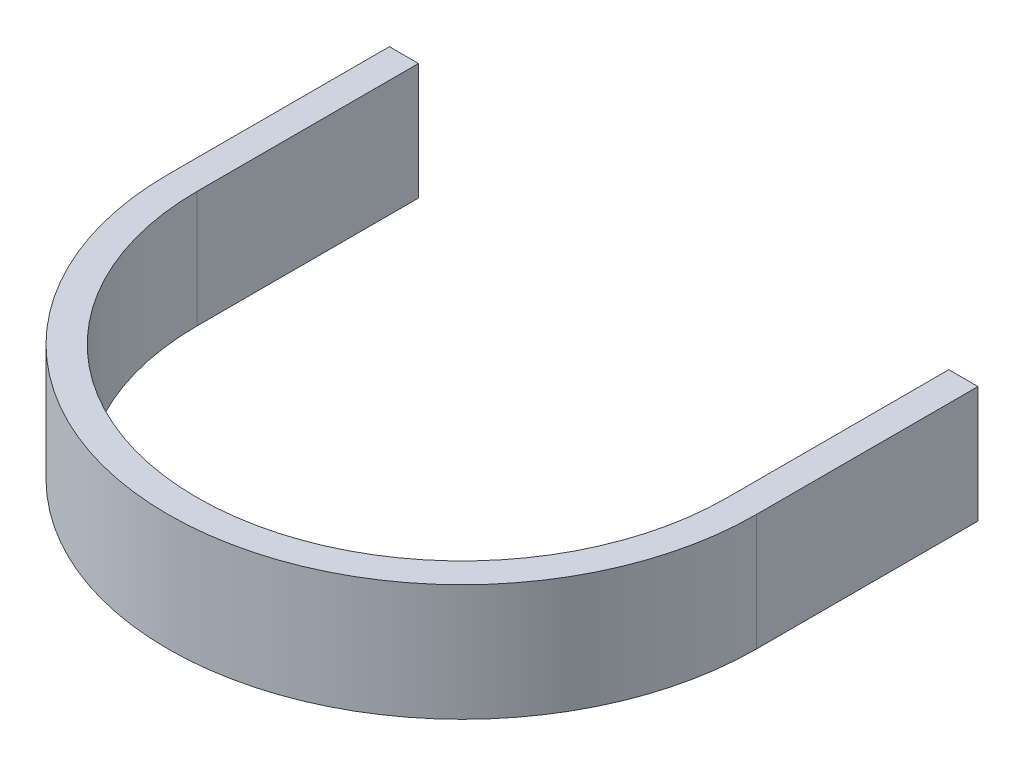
ISO-10303-21;
HEADER;
FILE_DESCRIPTION(('STEP AP214'),'2;1');
FILE_NAME('part.step','',(''),(''),'','','');
FILE_SCHEMA(('AUTOMOTIVE_DESIGN { 1 0 10303 214 1 1 1 1 }'));
ENDSEC;
DATA;
#1=APPLICATION_CONTEXT('core data for automotive mechanical design processes');
#2=APPLICATION_PROTOCOL_DEFINITION('international standard','automotive_design',2000,#1);
#3=PRODUCT_CONTEXT('',#1,'mechanical');
#4=PRODUCT('Part','Part','',(#3));
#5=PRODUCT_RELATED_PRODUCT_CATEGORY('part','',(#4));
#6=PRODUCT_DEFINITION_FORMATION('','',#4);
#7=PRODUCT_DEFINITION_CONTEXT('part definition',#1,'design');
#8=PRODUCT_DEFINITION('design','',#6,#7);
#9=PRODUCT_DEFINITION_SHAPE('','',#8);
#10=(LENGTH_UNIT() NAMED_UNIT(*) SI_UNIT(.MILLI.,.METRE.));
#11=(NAMED_UNIT(*) PLANE_ANGLE_UNIT() SI_UNIT($,.RADIAN.));
#12=(NAMED_UNIT(*) SI_UNIT($,.STERADIAN.) SOLID_ANGLE_UNIT());
#13=UNCERTAINTY_MEASURE_WITH_UNIT(LENGTH_MEASURE(1.E-05),#10,'distance_accuracy_value','');
#14=(GEOMETRIC_REPRESENTATION_CONTEXT(3) GLOBAL_UNCERTAINTY_ASSIGNED_CONTEXT((#13)) GLOBAL_UNIT_ASSIGNED_CONTEXT((#10,
#11,#12)) REPRESENTATION_CONTEXT('',''));
#15=CARTESIAN_POINT('',(0.,0.,0.));
#16=DIRECTION('',(0.,0.,1.));
#17=DIRECTION('',(1.,0.,0.));
#18=AXIS2_PLACEMENT_3D('',#15,#16,#17);
#19=CARTESIAN_POINT('',(-50.5,20.,-8.));
#20=DIRECTION('',(0.,0.,1.));
#21=DIRECTION('',(1.,0.,0.));
#22=AXIS2_PLACEMENT_3D('',#19,#20,#21);
#23=PLANE('',#22);
#24=DIRECTION('',(-1.,0.,0.));
#25=VECTOR('',#24,1.);
#26=CARTESIAN_POINT('',(-50.5,0.,-8.));
#27=LINE('',#26,#25);
#28=CARTESIAN_POINT('',(-45.5,0.,-8.));
#29=VERTEX_POINT('',#28);
#30=CARTESIAN_POINT('',(-50.5,0.,-8.));
#31=VERTEX_POINT('',#30);
#32=EDGE_CURVE('E129',#29,#31,#27,.T.);
#33=ORIENTED_EDGE('',*,*,#32,.T.);
#34=DIRECTION('',(0.,-1.,0.));
#35=VECTOR('',#34,1.);
#36=CARTESIAN_POINT('',(-50.5,20.,-8.));
#37=LINE('',#36,#35);
#38=CARTESIAN_POINT('',(-50.5,20.,-8.));
#39=VERTEX_POINT('',#38);
#40=EDGE_CURVE('E11',#39,#31,#37,.T.);
#41=ORIENTED_EDGE('',*,*,#40,.F.);
#42=DIRECTION('',(-1.,0.,0.));
#43=VECTOR('',#42,1.);
#44=CARTESIAN_POINT('',(-50.5,20.,-8.));
#45=LINE('',#44,#43);
#46=CARTESIAN_POINT('',(-45.5,20.,-8.));
#47=VERTEX_POINT('',#46);
#48=EDGE_CURVE('E143',#47,#39,#45,.T.);
#49=ORIENTED_EDGE('',*,*,#48,.F.);
#50=DIRECTION('',(0.,-1.,0.));
#51=VECTOR('',#50,1.);
#52=CARTESIAN_POINT('',(-45.5,20.,-8.));
#53=LINE('',#52,#51);
#54=EDGE_CURVE('E125',#47,#29,#53,.T.);
#55=ORIENTED_EDGE('',*,*,#54,.T.);
#56=EDGE_LOOP('',(#33,#41,#49,#55));
#57=FACE_BOUND('',#56,.T.);
#58=ADVANCED_FACE('F33',(#57),#23,.F.);
#59=CARTESIAN_POINT('',(-50.5,20.,30.));
#60=DIRECTION('',(1.,0.,0.));
#61=DIRECTION('',(0.,0.,-1.));
#62=AXIS2_PLACEMENT_3D('',#59,#60,#61);
#63=PLANE('',#62);
#64=DIRECTION('',(0.,0.,1.));
#65=VECTOR('',#64,1.);
#66=CARTESIAN_POINT('',(-50.5,0.,30.));
#67=LINE('',#66,#65);
#68=CARTESIAN_POINT('',(-50.5,0.,30.));
#69=VERTEX_POINT('',#68);
#70=EDGE_CURVE('E132',#31,#69,#67,.T.);
#71=ORIENTED_EDGE('',*,*,#70,.T.);
#72=DIRECTION('',(0.,-1.,0.));
#73=VECTOR('',#72,1.);
#74=CARTESIAN_POINT('',(-50.5,20.,30.));
#75=LINE('',#74,#73);
#76=CARTESIAN_POINT('',(-50.5,20.,30.));
#77=VERTEX_POINT('',#76);
#78=EDGE_CURVE('E41',#77,#69,#75,.T.);
#79=ORIENTED_EDGE('',*,*,#78,.F.);
#80=DIRECTION('',(0.,0.,1.));
#81=VECTOR('',#80,1.);
#82=CARTESIAN_POINT('',(-50.5,20.,30.));
#83=LINE('',#82,#81);
#84=EDGE_CURVE('E92',#39,#77,#83,.T.);
#85=ORIENTED_EDGE('',*,*,#84,.F.);
#86=ORIENTED_EDGE('',*,*,#40,.T.);
#87=EDGE_LOOP('',(#71,#79,#85,#86));
#88=FACE_BOUND('',#87,.T.);
#89=ADVANCED_FACE('F178',(#88),#63,.F.);
#90=CARTESIAN_POINT('',(0.,20.,30.));
#91=DIRECTION('',(0.,-1.,0.));
#92=DIRECTION('',(0.,0.,-1.));
#93=AXIS2_PLACEMENT_3D('',#90,#91,#92);
#94=CYLINDRICAL_SURFACE('',#93,50.5);
#95=CARTESIAN_POINT('',(0.,0.,30.));
#96=DIRECTION('',(0.,1.,0.));
#97=DIRECTION('',(0.,0.,1.));
#98=AXIS2_PLACEMENT_3D('',#95,#96,#97);
#99=CIRCLE('',#98,50.5);
#100=CARTESIAN_POINT('',(50.5,0.,30.));
#101=VERTEX_POINT('',#100);
#102=EDGE_CURVE('E134',#69,#101,#99,.T.);
#103=ORIENTED_EDGE('',*,*,#102,.T.);
#104=DIRECTION('',(0.,-1.,0.));
#105=VECTOR('',#104,1.);
#106=CARTESIAN_POINT('',(50.5,20.,30.));
#107=LINE('',#106,#105);
#108=CARTESIAN_POINT('',(50.5,20.,30.));
#109=VERTEX_POINT('',#108);
#110=EDGE_CURVE('E150',#109,#101,#107,.T.);
#111=ORIENTED_EDGE('',*,*,#110,.F.);
#112=CARTESIAN_POINT('',(0.,20.,30.));
#113=DIRECTION('',(0.,1.,0.));
#114=DIRECTION('',(0.,0.,1.));
#115=AXIS2_PLACEMENT_3D('',#112,#113,#114);
#116=CIRCLE('',#115,50.5);
#117=EDGE_CURVE('E158',#77,#109,#116,.T.);
#118=ORIENTED_EDGE('',*,*,#117,.F.);
#119=ORIENTED_EDGE('',*,*,#78,.T.);
#120=EDGE_LOOP('',(#103,#111,#118,#119));
#121=FACE_BOUND('',#120,.T.);
#122=ADVANCED_FACE('F156',(#121),#94,.T.);
#123=CARTESIAN_POINT('',(50.5,20.,30.));
#124=DIRECTION('',(-1.,0.,0.));
#125=DIRECTION('',(0.,0.,1.));
#126=AXIS2_PLACEMENT_3D('',#123,#124,#125);
#127=PLANE('',#126);
#128=DIRECTION('',(0.,0.,-1.));
#129=VECTOR('',#128,1.);
#130=CARTESIAN_POINT('',(50.5,0.,30.));
#131=LINE('',#130,#129);
#132=CARTESIAN_POINT('',(50.5,0.,-8.));
#133=VERTEX_POINT('',#132);
#134=EDGE_CURVE('E136',#101,#133,#131,.T.);
#135=ORIENTED_EDGE('',*,*,#134,.T.);
#136=DIRECTION('',(0.,-1.,0.));
#137=VECTOR('',#136,1.);
#138=CARTESIAN_POINT('',(50.5,20.,-8.));
#139=LINE('',#138,#137);
#140=CARTESIAN_POINT('',(50.5,20.,-8.));
#141=VERTEX_POINT('',#140);
#142=EDGE_CURVE('E147',#141,#133,#139,.T.);
#143=ORIENTED_EDGE('',*,*,#142,.F.);
#144=DIRECTION('',(0.,0.,-1.));
#145=VECTOR('',#144,1.);
#146=CARTESIAN_POINT('',(50.5,20.,30.));
#147=LINE('',#146,#145);
#148=EDGE_CURVE('E170',#109,#141,#147,.T.);
#149=ORIENTED_EDGE('',*,*,#148,.F.);
#150=ORIENTED_EDGE('',*,*,#110,.T.);
#151=EDGE_LOOP('',(#135,#143,#149,#150));
#152=FACE_BOUND('',#151,.T.);
#153=ADVANCED_FACE('F166',(#152),#127,.F.);
#154=CARTESIAN_POINT('',(50.5,20.,-8.));
#155=DIRECTION('',(0.,0.,1.));
#156=DIRECTION('',(1.,0.,0.));
#157=AXIS2_PLACEMENT_3D('',#154,#155,#156);
#158=PLANE('',#157);
#159=DIRECTION('',(-1.,0.,0.));
#160=VECTOR('',#159,1.);
#161=CARTESIAN_POINT('',(50.5,0.,-8.));
#162=LINE('',#161,#160);
#163=CARTESIAN_POINT('',(45.5,0.,-8.));
#164=VERTEX_POINT('',#163);
#165=EDGE_CURVE('E138',#133,#164,#162,.T.);
#166=ORIENTED_EDGE('',*,*,#165,.T.);
#167=DIRECTION('',(0.,-1.,0.));
#168=VECTOR('',#167,1.);
#169=CARTESIAN_POINT('',(45.5,20.,-8.));
#170=LINE('',#169,#168);
#171=CARTESIAN_POINT('',(45.5,20.,-8.));
#172=VERTEX_POINT('',#171);
#173=EDGE_CURVE('E120',#172,#164,#170,.T.);
#174=ORIENTED_EDGE('',*,*,#173,.F.);
#175=DIRECTION('',(-1.,0.,0.));
#176=VECTOR('',#175,1.);
#177=CARTESIAN_POINT('',(50.5,20.,-8.));
#178=LINE('',#177,#176);
#179=EDGE_CURVE('E111',#141,#172,#178,.T.);
#180=ORIENTED_EDGE('',*,*,#179,.F.);
#181=ORIENTED_EDGE('',*,*,#142,.T.);
#182=EDGE_LOOP('',(#166,#174,#180,#181));
#183=FACE_BOUND('',#182,.T.);
#184=ADVANCED_FACE('F169',(#183),#158,.F.);
#185=CARTESIAN_POINT('',(45.5,20.,-8.));
#186=DIRECTION('',(1.,0.,0.));
#187=DIRECTION('',(0.,0.,-1.));
#188=AXIS2_PLACEMENT_3D('',#185,#186,#187);
#189=PLANE('',#188);
#190=DIRECTION('',(0.,0.,1.));
#191=VECTOR('',#190,1.);
#192=CARTESIAN_POINT('',(45.5,0.,-8.));
#193=LINE('',#192,#191);
#194=CARTESIAN_POINT('',(45.5,0.,30.));
#195=VERTEX_POINT('',#194);
#196=EDGE_CURVE('E119',#164,#195,#193,.T.);
#197=ORIENTED_EDGE('',*,*,#196,.T.);
#198=DIRECTION('',(0.,-1.,0.));
#199=VECTOR('',#198,1.);
#200=CARTESIAN_POINT('',(45.5,20.,30.));
#201=LINE('',#200,#199);
#202=CARTESIAN_POINT('',(45.5,20.,30.));
#203=VERTEX_POINT('',#202);
#204=EDGE_CURVE('E116',#203,#195,#201,.T.);
#205=ORIENTED_EDGE('',*,*,#204,.F.);
#206=DIRECTION('',(0.,0.,1.));
#207=VECTOR('',#206,1.);
#208=CARTESIAN_POINT('',(45.5,20.,-8.));
#209=LINE('',#208,#207);
#210=EDGE_CURVE('E105',#172,#203,#209,.T.);
#211=ORIENTED_EDGE('',*,*,#210,.F.);
#212=ORIENTED_EDGE('',*,*,#173,.T.);
#213=EDGE_LOOP('',(#197,#205,#211,#212));
#214=FACE_BOUND('',#213,.T.);
#215=ADVANCED_FACE('F117',(#214),#189,.F.);
#216=CARTESIAN_POINT('',(0.,20.,30.));
#217=DIRECTION('',(0.,-1.,0.));
#218=DIRECTION('',(0.,0.,-1.));
#219=AXIS2_PLACEMENT_3D('',#216,#217,#218);
#220=CYLINDRICAL_SURFACE('',#219,45.5);
#221=CARTESIAN_POINT('',(0.,0.,30.));
#222=DIRECTION('',(0.,-1.,0.));
#223=DIRECTION('',(0.,0.,1.));
#224=AXIS2_PLACEMENT_3D('',#221,#222,#223);
#225=CIRCLE('',#224,45.5);
#226=CARTESIAN_POINT('',(-45.5,0.,30.));
#227=VERTEX_POINT('',#226);
#228=EDGE_CURVE('E78',#195,#227,#225,.T.);
#229=ORIENTED_EDGE('',*,*,#228,.T.);
#230=DIRECTION('',(0.,-1.,0.));
#231=VECTOR('',#230,1.);
#232=CARTESIAN_POINT('',(-45.5,20.,30.));
#233=LINE('',#232,#231);
#234=CARTESIAN_POINT('',(-45.5,20.,30.));
#235=VERTEX_POINT('',#234);
#236=EDGE_CURVE('E121',#235,#227,#233,.T.);
#237=ORIENTED_EDGE('',*,*,#236,.F.);
#238=CARTESIAN_POINT('',(0.,20.,30.));
#239=DIRECTION('',(0.,-1.,0.));
#240=DIRECTION('',(0.,0.,1.));
#241=AXIS2_PLACEMENT_3D('',#238,#239,#240);
#242=CIRCLE('',#241,45.5);
#243=EDGE_CURVE('E109',#203,#235,#242,.T.);
#244=ORIENTED_EDGE('',*,*,#243,.F.);
#245=ORIENTED_EDGE('',*,*,#204,.T.);
#246=EDGE_LOOP('',(#229,#237,#244,#245));
#247=FACE_BOUND('',#246,.T.);
#248=ADVANCED_FACE('F123',(#247),#220,.F.);
#249=CARTESIAN_POINT('',(-45.5,20.,-8.));
#250=DIRECTION('',(-1.,0.,0.));
#251=DIRECTION('',(0.,0.,1.));
#252=AXIS2_PLACEMENT_3D('',#249,#250,#251);
#253=PLANE('',#252);
#254=DIRECTION('',(0.,0.,-1.));
#255=VECTOR('',#254,1.);
#256=CARTESIAN_POINT('',(-45.5,0.,-8.));
#257=LINE('',#256,#255);
#258=EDGE_CURVE('E84',#227,#29,#257,.T.);
#259=ORIENTED_EDGE('',*,*,#258,.T.);
#260=ORIENTED_EDGE('',*,*,#54,.F.);
#261=DIRECTION('',(0.,0.,-1.));
#262=VECTOR('',#261,1.);
#263=CARTESIAN_POINT('',(-45.5,20.,-8.));
#264=LINE('',#263,#262);
#265=EDGE_CURVE('E49',#235,#47,#264,.T.);
#266=ORIENTED_EDGE('',*,*,#265,.F.);
#267=ORIENTED_EDGE('',*,*,#236,.T.);
#268=EDGE_LOOP('',(#259,#260,#266,#267));
#269=FACE_BOUND('',#268,.T.);
#270=ADVANCED_FACE('F194',(#269),#253,.F.);
#271=CARTESIAN_POINT('',(0.,20.,30.));
#272=DIRECTION('',(0.,1.,0.));
#273=DIRECTION('',(0.,0.,1.));
#274=AXIS2_PLACEMENT_3D('',#271,#272,#273);
#275=PLANE('',#274);
#276=ORIENTED_EDGE('',*,*,#48,.T.);
#277=ORIENTED_EDGE('',*,*,#84,.T.);
#278=ORIENTED_EDGE('',*,*,#117,.T.);
#279=ORIENTED_EDGE('',*,*,#148,.T.);
#280=ORIENTED_EDGE('',*,*,#179,.T.);
#281=ORIENTED_EDGE('',*,*,#210,.T.);
#282=ORIENTED_EDGE('',*,*,#243,.T.);
#283=ORIENTED_EDGE('',*,*,#265,.T.);
#284=EDGE_LOOP('',(#276,#277,#278,#279,#280,#281,#282,#283));
#285=FACE_BOUND('',#284,.T.);
#286=ADVANCED_FACE('F107',(#285),#275,.T.);
#287=CARTESIAN_POINT('',(0.,0.,30.));
#288=DIRECTION('',(0.,1.,0.));
#289=DIRECTION('',(0.,0.,1.));
#290=AXIS2_PLACEMENT_3D('',#287,#288,#289);
#291=PLANE('',#290);
#292=ORIENTED_EDGE('',*,*,#32,.F.);
#293=ORIENTED_EDGE('',*,*,#258,.F.);
#294=ORIENTED_EDGE('',*,*,#228,.F.);
#295=ORIENTED_EDGE('',*,*,#196,.F.);
#296=ORIENTED_EDGE('',*,*,#165,.F.);
#297=ORIENTED_EDGE('',*,*,#134,.F.);
#298=ORIENTED_EDGE('',*,*,#102,.F.);
#299=ORIENTED_EDGE('',*,*,#70,.F.);
#300=EDGE_LOOP('',(#292,#293,#294,#295,#296,#297,#298,#299));
#301=FACE_BOUND('',#300,.T.);
#302=ADVANCED_FACE('F162',(#301),#291,.F.);
#303=CLOSED_SHELL('',(#58,#89,#122,#153,#184,#215,#248,#270,#286,#302));
#304=MANIFOLD_SOLID_BREP('B2',#303);
#305=ADVANCED_BREP_SHAPE_REPRESENTATION('',(#18,#304),#14);
#306=SHAPE_DEFINITION_REPRESENTATION(#9,#305);
ENDSEC;
END-ISO-10303-21;
